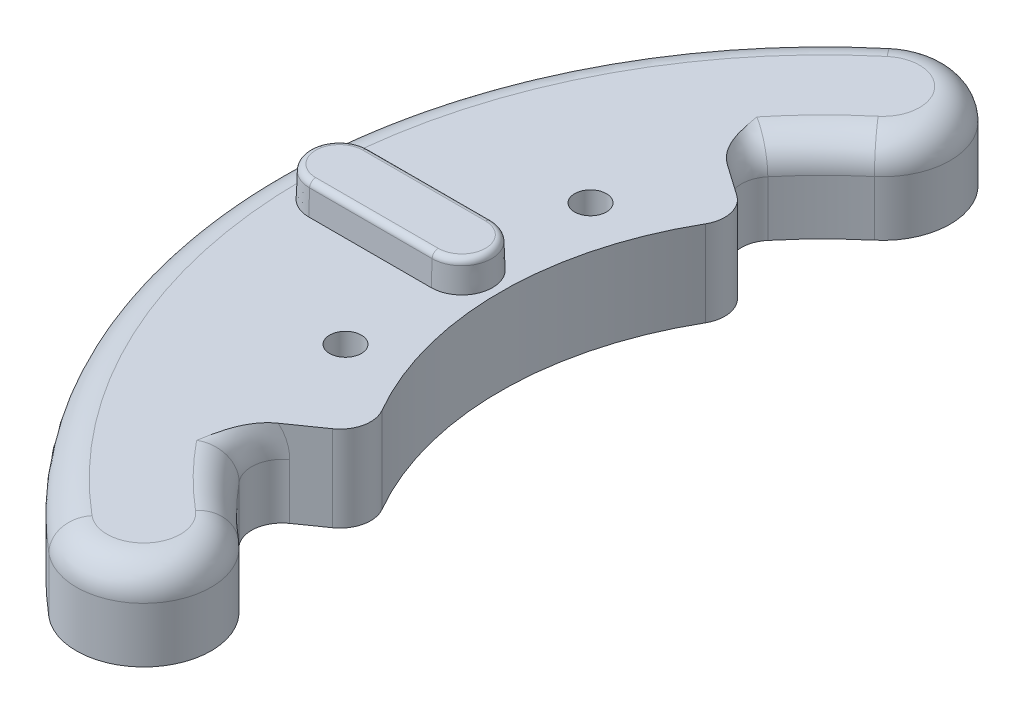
from build123d import *

# Parameters (mm, degrees)
BOSS_EXTRUDE1_DEPTH   = 8.89
SHELL1_T              = -1.27
MOVE_FACE1_BY         = 1.905
BOSS_EXTRUDE2_DEPTH   = 8.89
EXTRUDE_THIN1_DEPTH   = 5.08
FILLET1_R             = 3.175
FILLET2_R             = 3.175
M4X0_7_TAPPED_HOLE1_D = 3.3
BOSS_EXTRUDE4_DEPTH   = 3.175
BOSS_EXTRUDE4_TAPER   = 2
FILLET3_R             = 0.635


with BuildPart() as part:
    # Sketch1 → Boss-Extrude1 (new body)
    with BuildSketch(Plane(origin=(0, 0, 0), x_dir=(1, 0, 0), z_dir=(0, 1, 0))):
        with BuildLine():
            ThreePointArc((-27.649509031, 32.951401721), (-43.015, 0), (-27.649509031, -32.951401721))
            ThreePointArc((-27.649509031, -32.951401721), (-26.788560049, -42.79209361), (-36.629251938, -43.653042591))
            ThreePointArc((-36.629251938, -43.653042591), (-56.985, 0), (-36.629251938, 43.653042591))
            ThreePointArc((-36.629251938, 43.653042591), (-26.788560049, 42.79209361), (-27.649509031, 32.951401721))
        make_face()
    extrude(amount=BOSS_EXTRUDE1_DEPTH)

    # Shell1
    shell1_openings = [part.faces().sort_by_distance(p)[0] for p in [
        (-27.523999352, 0, -42.174986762),
    ]]
    offset(amount=SHELL1_T, openings=shell1_openings, kind=Kind.INTERSECTION)

    # Move Face1: a face moved outward by 1.905
    extrude(part.faces().sort_by_distance((-41.069690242, 7.62, 22.008611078))[0], amount=MOVE_FACE1_BY, dir=(0, -1, 0))

    # Sketch2 → Boss-Extrude2 (add)
    with BuildSketch(Plane.XZ):
        with BuildLine():
            Line((-27.433401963, 19.209074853), (-35.235825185, 24.67239041))
            ThreePointArc((-35.235825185, 24.67239041), (-43.015, 0), (-35.235825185, -24.67239041))
            Line((-35.235825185, -24.67239041), (-27.433401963, -19.209074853))
            ThreePointArc((-27.433401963, -19.209074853), (-33.49, 0), (-27.433401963, 19.209074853))
        make_face()
    extrude(amount=-BOSS_EXTRUDE2_DEPTH)

    # Sketch5 → Extrude-Thin1 (add)
    with BuildSketch(Plane.XZ.offset(-5.715)):
        with BuildLine():
            ThreePointArc((-29.730675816, 44.23563254), (-50.465456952, 17.144734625), (-50.524338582, -16.970429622))
            Line((-50.524338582, -16.970429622), (-49.561216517, -16.646930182))
            ThreePointArc((-49.561216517, -16.646930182), (-49.50345732, 16.817912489), (-29.163933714, 43.392389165))
            Line((-29.163933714, 43.392389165), (-29.730675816, 44.23563254))
        make_face()
        with BuildLine():
            ThreePointArc((-37.541871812, -27.779523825), (-46.046092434, -7.800734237), (-44.596810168, 13.864292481))
            Line((-44.596810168, 13.864292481), (-45.56700801, 14.165908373))
            ThreePointArc((-45.56700801, 14.165908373), (-47.047819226, -7.970438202), (-38.358590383, -28.383863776))
            Line((-38.358590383, -28.383863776), (-37.541871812, -27.779523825))
        make_face()
    extrude(amount=EXTRUDE_THIN1_DEPTH)

    # Fillet1
    fillet1_edges = [part.edges().sort_by_distance(p)[0] for p in [
        (-26.788560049, 8.89, 42.79209361),
        (-31.713984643, 8.89, 29.060512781),
        (-31.713984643, 8.89, -29.060512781),
        (-26.788560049, 8.89, -42.79209361),
        (-56.985, 8.89, 0),
    ]]
    fillet(fillet1_edges, radius=FILLET1_R)

    # Fillet2
    fillet2_edges = [part.edges().sort_by_distance(p)[0] for p in [
        (-27.433401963, 4.445, -19.209074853),
        (-27.433401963, 4.445, 19.209074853),
        (-35.235825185, 2.8575, -24.67239041),
        (-35.235825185, 2.8575, 24.67239041),
        (-35.997584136, 7.96006403, -25.205779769),
        (-35.997584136, 7.96006403, 25.205779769),
    ]]
    fillet(fillet2_edges, radius=FILLET2_R)

    # M4x0.7 Tapped Hole1 (through all)
    with Locations(Plane(origin=(0, 8.89, 0), x_dir=(1, 0, 0), z_dir=(0, 1, 0))):
        with Locations((-36.83, 12.7), (-36.83, -12.7)):
            Hole(M4X0_7_TAPPED_HOLE1_D / 2)

    # Sketch12 → Boss-Extrude4 (add)
    with BuildSketch(Plane(origin=(0, 8.89, 0), x_dir=(1, 0, 0), z_dir=(0, 1, 0))):
        with BuildLine():
            ThreePointArc((-50.165, 3.175), (-53.34, 0), (-50.165, -3.175))
            Line((-50.165, -3.175), (-37.465, -3.175))
            ThreePointArc((-37.465, -3.175), (-34.29, 0), (-37.465, 3.175))
            Line((-37.465, 3.175), (-50.165, 3.175))
        make_face()
    extrude(amount=BOSS_EXTRUDE4_DEPTH, taper=BOSS_EXTRUDE4_TAPER)

    # Fillet3
    fillet3_edges = [part.edges().sort_by_distance(p)[0] for p in [
        (-53.229126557, 12.065, 0),
        (-43.815, 12.065, 3.064126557),
        (-34.400873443, 12.065, 0),
        (-43.815, 12.065, -3.064126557),
    ]]
    fillet(fillet3_edges, radius=FILLET3_R)


solid = part.part
